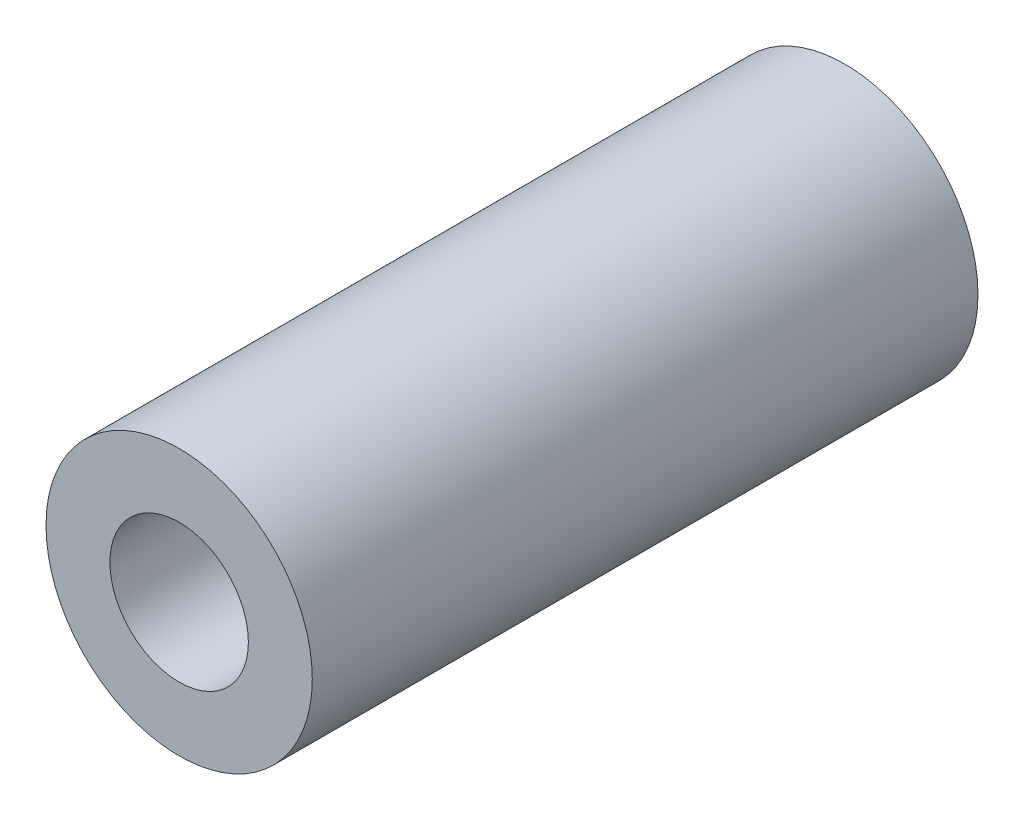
ISO-10303-21;
HEADER;
FILE_DESCRIPTION(('STEP AP214'),'2;1');
FILE_NAME('part.step','',(''),(''),'','','');
FILE_SCHEMA(('AUTOMOTIVE_DESIGN { 1 0 10303 214 1 1 1 1 }'));
ENDSEC;
DATA;
#1=APPLICATION_CONTEXT('core data for automotive mechanical design processes');
#2=APPLICATION_PROTOCOL_DEFINITION('international standard','automotive_design',2000,#1);
#3=PRODUCT_CONTEXT('',#1,'mechanical');
#4=PRODUCT('Part','Part','',(#3));
#5=PRODUCT_RELATED_PRODUCT_CATEGORY('part','',(#4));
#6=PRODUCT_DEFINITION_FORMATION('','',#4);
#7=PRODUCT_DEFINITION_CONTEXT('part definition',#1,'design');
#8=PRODUCT_DEFINITION('design','',#6,#7);
#9=PRODUCT_DEFINITION_SHAPE('','',#8);
#10=(LENGTH_UNIT() NAMED_UNIT(*) SI_UNIT(.MILLI.,.METRE.));
#11=(NAMED_UNIT(*) PLANE_ANGLE_UNIT() SI_UNIT($,.RADIAN.));
#12=(NAMED_UNIT(*) SI_UNIT($,.STERADIAN.) SOLID_ANGLE_UNIT());
#13=UNCERTAINTY_MEASURE_WITH_UNIT(LENGTH_MEASURE(1.E-05),#10,'distance_accuracy_value','');
#14=(GEOMETRIC_REPRESENTATION_CONTEXT(3) GLOBAL_UNCERTAINTY_ASSIGNED_CONTEXT((#13)) GLOBAL_UNIT_ASSIGNED_CONTEXT((#10,
#11,#12)) REPRESENTATION_CONTEXT('',''));
#15=CARTESIAN_POINT('',(0.,0.,0.));
#16=DIRECTION('',(0.,0.,1.));
#17=DIRECTION('',(1.,0.,0.));
#18=AXIS2_PLACEMENT_3D('',#15,#16,#17);
#19=CARTESIAN_POINT('',(0.,0.,40.));
#20=DIRECTION('',(0.,0.,1.));
#21=DIRECTION('',(1.,0.,0.));
#22=AXIS2_PLACEMENT_3D('',#19,#20,#21);
#23=CYLINDRICAL_SURFACE('',#22,8.);
#24=CARTESIAN_POINT('',(0.,0.,0.));
#25=DIRECTION('',(0.,0.,1.));
#26=DIRECTION('',(1.,0.,0.));
#27=AXIS2_PLACEMENT_3D('',#24,#25,#26);
#28=CIRCLE('',#27,8.);
#29=CARTESIAN_POINT('',(8.,0.,0.));
#30=VERTEX_POINT('',#29);
#31=EDGE_CURVE('E8',#30,#30,#28,.T.);
#32=ORIENTED_EDGE('',*,*,#31,.F.);
#33=EDGE_LOOP('',(#32));
#34=FACE_BOUND('',#33,.T.);
#35=CARTESIAN_POINT('',(0.,0.,25.));
#36=DIRECTION('',(0.,0.,1.));
#37=DIRECTION('',(1.,0.,0.));
#38=AXIS2_PLACEMENT_3D('',#35,#36,#37);
#39=CIRCLE('',#38,8.);
#40=CARTESIAN_POINT('',(8.,0.,25.));
#41=VERTEX_POINT('',#40);
#42=EDGE_CURVE('E34',#41,#41,#39,.T.);
#43=ORIENTED_EDGE('',*,*,#42,.T.);
#44=EDGE_LOOP('',(#43));
#45=FACE_BOUND('',#44,.T.);
#46=ADVANCED_FACE('F12',(#34,#45),#23,.F.);
#47=CARTESIAN_POINT('',(8.,0.,0.));
#48=DIRECTION('',(0.,0.,1.));
#49=DIRECTION('',(1.,0.,0.));
#50=AXIS2_PLACEMENT_3D('',#47,#48,#49);
#51=PLANE('',#50);
#52=CARTESIAN_POINT('',(0.,0.,0.));
#53=DIRECTION('',(0.,0.,1.));
#54=DIRECTION('',(1.,0.,0.));
#55=AXIS2_PLACEMENT_3D('',#52,#53,#54);
#56=CIRCLE('',#55,25.);
#57=CARTESIAN_POINT('',(25.,0.,0.));
#58=VERTEX_POINT('',#57);
#59=EDGE_CURVE('E18',#58,#58,#56,.T.);
#60=ORIENTED_EDGE('',*,*,#59,.F.);
#61=EDGE_LOOP('',(#60));
#62=FACE_BOUND('',#61,.T.);
#63=ORIENTED_EDGE('',*,*,#31,.T.);
#64=EDGE_LOOP('',(#63));
#65=FACE_BOUND('',#64,.T.);
#66=ADVANCED_FACE('F59',(#62,#65),#51,.F.);
#67=CARTESIAN_POINT('',(0.,0.,40.));
#68=DIRECTION('',(0.,0.,1.));
#69=DIRECTION('',(1.,0.,0.));
#70=AXIS2_PLACEMENT_3D('',#67,#68,#69);
#71=CYLINDRICAL_SURFACE('',#70,25.);
#72=CARTESIAN_POINT('',(0.,0.,125.));
#73=DIRECTION('',(0.,0.,1.));
#74=DIRECTION('',(1.,0.,0.));
#75=AXIS2_PLACEMENT_3D('',#72,#73,#74);
#76=CIRCLE('',#75,25.);
#77=CARTESIAN_POINT('',(25.,0.,125.));
#78=VERTEX_POINT('',#77);
#79=EDGE_CURVE('E22',#78,#78,#76,.T.);
#80=ORIENTED_EDGE('',*,*,#79,.F.);
#81=EDGE_LOOP('',(#80));
#82=FACE_BOUND('',#81,.T.);
#83=ORIENTED_EDGE('',*,*,#59,.T.);
#84=EDGE_LOOP('',(#83));
#85=FACE_BOUND('',#84,.T.);
#86=ADVANCED_FACE('F54',(#82,#85),#71,.T.);
#87=CARTESIAN_POINT('',(25.,0.,125.));
#88=DIRECTION('',(0.,0.,-1.));
#89=DIRECTION('',(-1.,0.,0.));
#90=AXIS2_PLACEMENT_3D('',#87,#88,#89);
#91=PLANE('',#90);
#92=CARTESIAN_POINT('',(0.,0.,125.));
#93=DIRECTION('',(0.,0.,1.));
#94=DIRECTION('',(1.,0.,0.));
#95=AXIS2_PLACEMENT_3D('',#92,#93,#94);
#96=CIRCLE('',#95,13.);
#97=CARTESIAN_POINT('',(13.,0.,125.));
#98=VERTEX_POINT('',#97);
#99=EDGE_CURVE('E26',#98,#98,#96,.T.);
#100=ORIENTED_EDGE('',*,*,#99,.F.);
#101=EDGE_LOOP('',(#100));
#102=FACE_BOUND('',#101,.T.);
#103=ORIENTED_EDGE('',*,*,#79,.T.);
#104=EDGE_LOOP('',(#103));
#105=FACE_BOUND('',#104,.T.);
#106=ADVANCED_FACE('F48',(#102,#105),#91,.F.);
#107=CARTESIAN_POINT('',(0.,0.,40.));
#108=DIRECTION('',(0.,0.,1.));
#109=DIRECTION('',(1.,0.,0.));
#110=AXIS2_PLACEMENT_3D('',#107,#108,#109);
#111=CYLINDRICAL_SURFACE('',#110,13.);
#112=CARTESIAN_POINT('',(0.,0.,25.));
#113=DIRECTION('',(0.,0.,1.));
#114=DIRECTION('',(1.,0.,0.));
#115=AXIS2_PLACEMENT_3D('',#112,#113,#114);
#116=CIRCLE('',#115,13.);
#117=CARTESIAN_POINT('',(13.,0.,25.));
#118=VERTEX_POINT('',#117);
#119=EDGE_CURVE('E31',#118,#118,#116,.T.);
#120=ORIENTED_EDGE('',*,*,#119,.F.);
#121=EDGE_LOOP('',(#120));
#122=FACE_BOUND('',#121,.T.);
#123=ORIENTED_EDGE('',*,*,#99,.T.);
#124=EDGE_LOOP('',(#123));
#125=FACE_BOUND('',#124,.T.);
#126=ADVANCED_FACE('F42',(#122,#125),#111,.F.);
#127=CARTESIAN_POINT('',(13.,0.,25.));
#128=DIRECTION('',(0.,0.,-1.));
#129=DIRECTION('',(-1.,0.,0.));
#130=AXIS2_PLACEMENT_3D('',#127,#128,#129);
#131=PLANE('',#130);
#132=ORIENTED_EDGE('',*,*,#42,.F.);
#133=EDGE_LOOP('',(#132));
#134=FACE_BOUND('',#133,.T.);
#135=ORIENTED_EDGE('',*,*,#119,.T.);
#136=EDGE_LOOP('',(#135));
#137=FACE_BOUND('',#136,.T.);
#138=ADVANCED_FACE('F39',(#134,#137),#131,.F.);
#139=CLOSED_SHELL('',(#46,#66,#86,#106,#126,#138));
#140=MANIFOLD_SOLID_BREP('B1',#139);
#141=ADVANCED_BREP_SHAPE_REPRESENTATION('',(#18,#140),#14);
#142=SHAPE_DEFINITION_REPRESENTATION(#9,#141);
ENDSEC;
END-ISO-10303-21;
